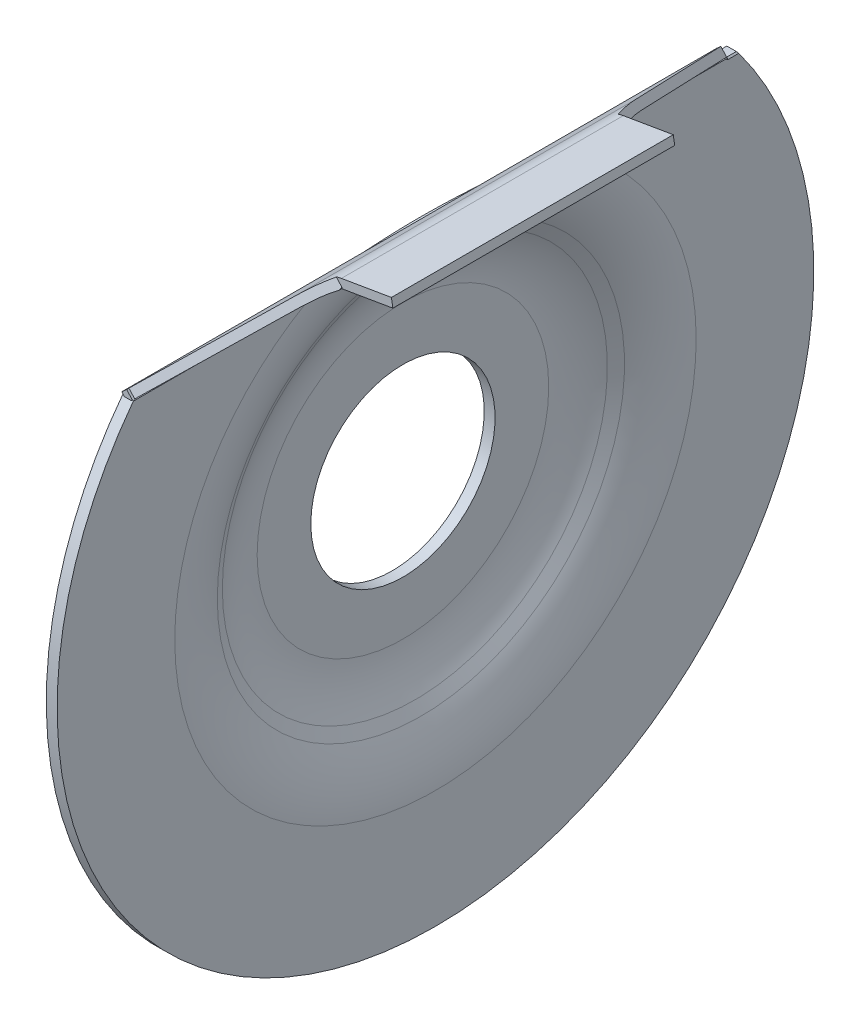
from build123d import *

# Parameters (mm, degrees)
SKETCH2_W               = 55.639145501
SKETCH2_H               = 16.990893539
CUT_EXTRUDE1_DEPTH      = 10
SKETCH5_W               = 54.879114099
SKETCH5_H               = 0.8
CUT_EXTRUDE3_DEPTH      = 30
CUT_EXTRUDE4_DEPTH      = 5
CUT_EXTRUDE4_DEPTH_BACK = 5


with BuildPart() as part:
    # Sketch1 → Revolve-Thin1 (revolve)
    with BuildSketch(Plane.XY, mode=Mode.PRIVATE) as revolve_thin1_sk:
        with BuildLine():
            Line((0, 8.5), (0, 13.450059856))
            ThreePointArc((0, 13.450059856), (0.310068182, 15.92093447), (1.221044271, 18.238581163))
            Line((1.221044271, 18.238581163), (1.778955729, 19.261418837))
            ThreePointArc((1.778955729, 19.261418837), (2.689931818, 21.57906553), (3, 24.049940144))
            Line((3, 24.049940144), (3, 34.9))
            Line((3, 34.9), (4, 34.9))
            Line((4, 34.9), (4, 24.049940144))
            ThreePointArc((4, 24.049940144), (3.658925, 21.331978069), (2.656851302, 18.782566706))
            Line((2.656851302, 18.782566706), (2.098939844, 17.759729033))
            ThreePointArc((2.098939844, 17.759729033), (1.279061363, 15.673847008), (1, 13.450059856))
            Line((1, 13.450059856), (1, 8.5))
            Line((1, 8.5), (0, 8.5))
        make_face()
    revolve(revolve_thin1_sk.sketch.rotate(Axis((0, 0, 0), (1, 0, 0)), 90), axis=Axis((0, 0, 0), (1, 0, 0)))

    # Sketch2 → Cut-Extrude1 (cut)
    with BuildSketch(Plane(origin=(4, 0, 0), x_dir=(0, 0, -1), z_dir=(1, 0, 0))):
        with Locations((0.13471948, 29.49544677)):
            Rectangle(SKETCH2_W, SKETCH2_H)
    extrude(amount=-CUT_EXTRUDE1_DEPTH, mode=Mode.SUBTRACT)

    # Sweep3: sweep along a path in Sketch4
    with BuildLine(Plane.XY) as sweep3_path:
        Line((3.490798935, 20.651133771), (7.445704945, 24.257549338))
        ThreePointArc((7.445704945, 24.257549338), (7.916866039, 24.577459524), (8.459092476, 24.751602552))
        Line((8.459092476, 24.751602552), (13.068366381, 25.532835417))
    # Sketch5 → Sweep3 (sweep)
    with BuildSketch(Plane(origin=(13.068366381, 25.532835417, 0), x_dir=(0, 0, -1), z_dir=(0.9859385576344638, 0.16710823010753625, 0))):
        with Locations((-0.45515853, 0.396582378)):
            Rectangle(SKETCH5_W, SKETCH5_H)
    sweep(path=sweep3_path.line)

    # Sketch7 → Cut-Extrude3 (cut)
    with BuildSketch(Plane(origin=(0, 0, 0), x_dir=(1, 0, 0), z_dir=(0, 1, 0))):
        Polygon((8.360934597, 13), (14.341567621, 13), (14.341567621, -13), (8.360934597, -13), (8.360934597, -37.384225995), (24.454868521, -37.384225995), (24.454868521, 38.192542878), (8.360934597, 38.192542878), align=None)
    extrude(amount=CUT_EXTRUDE3_DEPTH, mode=Mode.SUBTRACT)

    # Sketch8 → Cut-Extrude4 (cut, two sides: drawn at the far end of the back side and taken through both)
    with BuildSketch(Plane(origin=(-8.69463626, 9.534805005, 0), x_dir=(0.7389119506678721, 0.6738019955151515, 0), z_dir=(0.6738019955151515, -0.7389119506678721, 0)).offset(-CUT_EXTRUDE4_DEPTH_BACK)):
        Polygon((17.01567385, -26.98439852), (22.926355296, -13), (29.650422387, -13), (30.728178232, -31.793797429), (17.01567385, -31.793797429), align=None)
        Polygon((17.105489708, 27.68485327), (22.926355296, 13), (29.650422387, 13), (29.650422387, 31.619680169), (17.105489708, 31.619680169), align=None)
    extrude(amount=CUT_EXTRUDE4_DEPTH + CUT_EXTRUDE4_DEPTH_BACK, mode=Mode.SUBTRACT)


solid = part.part
